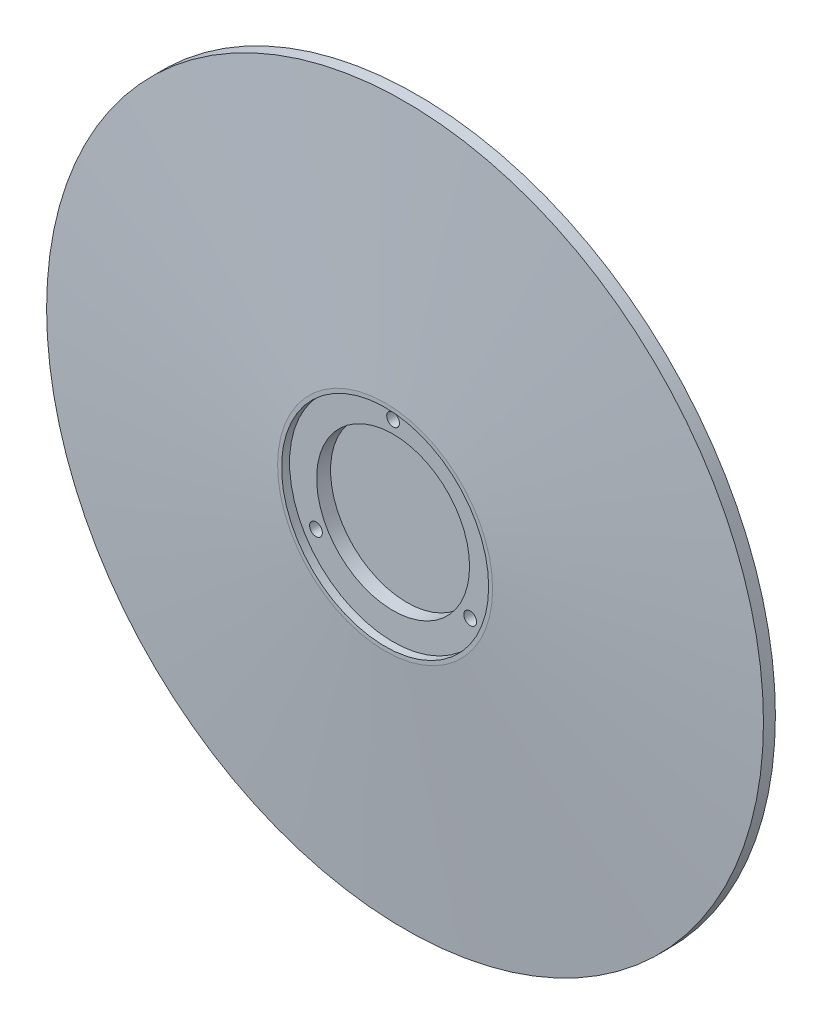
from build123d import *

# Parameters (mm, degrees)
SKETCH_2_R          = 26
CUT_EXTRUDE_1_DEPTH = 2
SKETCH_3_R          = 19.2
CUT_EXTRUDE_2_DEPTH = 3.5
SKETCH_4_R          = 1.6
CUT_EXTRUDE_3_DEPTH = 4


with BuildPart() as part:
    # Sketch 1 → Revolve 1 (revolve)
    with BuildSketch(Plane(origin=(0, 0, 0), x_dir=(0, 0, -1), z_dir=(1, 0, 0)), mode=Mode.PRIVATE) as revolve_1_sk:
        Polygon((0, 0), (0, 90), (-3, 90), (-8, 27), (-8, 0), align=None)
    revolve(revolve_1_sk.sketch.rotate(Axis((0, 0, -33.350854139), (0, 0, 1)), 90), axis=Axis((0, 0, -33.350854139), (0, 0, 1)))

    # Sketch 2 → Cut-Extrude 1 (cut)
    with BuildSketch(Plane.XY.offset(8)):
        Circle(SKETCH_2_R)
    extrude(amount=-CUT_EXTRUDE_1_DEPTH, mode=Mode.SUBTRACT)

    # Sketch 3 → Cut-Extrude 2 (cut)
    with BuildSketch(Plane.XY.offset(6)):
        Circle(SKETCH_3_R)
    extrude(amount=-CUT_EXTRUDE_2_DEPTH, mode=Mode.SUBTRACT)

    # Sketch 4 → Cut-Extrude 3 (cut)
    with BuildSketch(Plane.XY.offset(6)):
        with Locations((0, 22.35)):
            Circle(SKETCH_4_R)
        with Locations((19.355667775, -11.175)):
            Circle(SKETCH_4_R)
        with Locations((-19.355667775, -11.175)):
            Circle(SKETCH_4_R)
    extrude(amount=-CUT_EXTRUDE_3_DEPTH, mode=Mode.SUBTRACT)


solid = part.part
